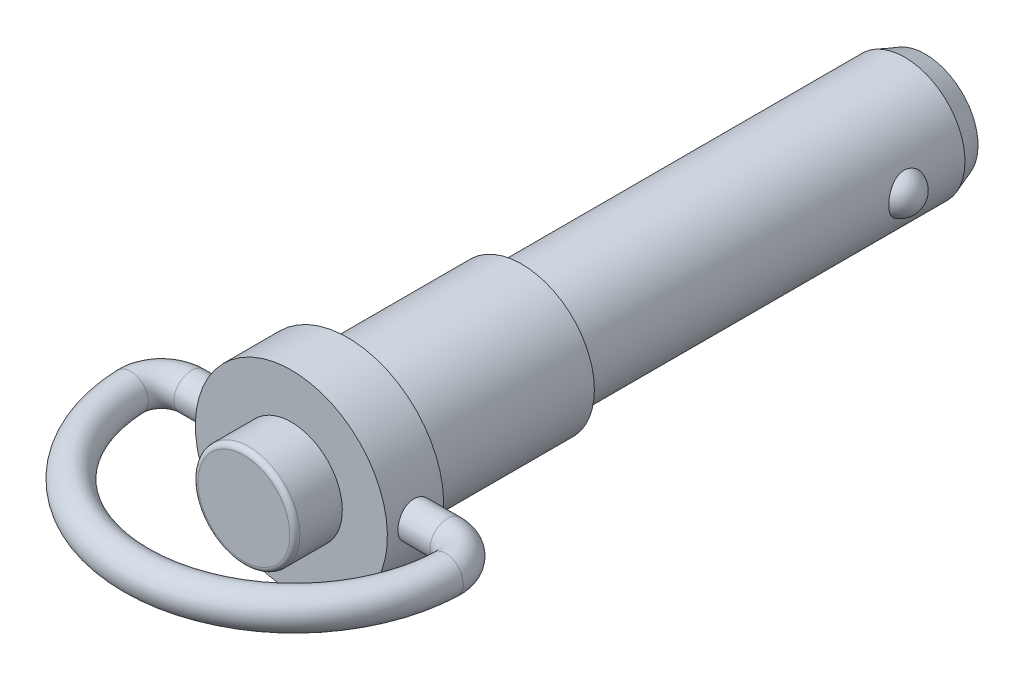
ISO-10303-21;
HEADER;
FILE_DESCRIPTION(('STEP AP214'),'2;1');
FILE_NAME('part.step','',(''),(''),'','','');
FILE_SCHEMA(('AUTOMOTIVE_DESIGN { 1 0 10303 214 1 1 1 1 }'));
ENDSEC;
DATA;
#1=APPLICATION_CONTEXT('core data for automotive mechanical design processes');
#2=APPLICATION_PROTOCOL_DEFINITION('international standard','automotive_design',2000,#1);
#3=PRODUCT_CONTEXT('',#1,'mechanical');
#4=PRODUCT('Part','Part','',(#3));
#5=PRODUCT_RELATED_PRODUCT_CATEGORY('part','',(#4));
#6=PRODUCT_DEFINITION_FORMATION('','',#4);
#7=PRODUCT_DEFINITION_CONTEXT('part definition',#1,'design');
#8=PRODUCT_DEFINITION('design','',#6,#7);
#9=PRODUCT_DEFINITION_SHAPE('','',#8);
#10=(LENGTH_UNIT() NAMED_UNIT(*) SI_UNIT(.MILLI.,.METRE.));
#11=(NAMED_UNIT(*) PLANE_ANGLE_UNIT() SI_UNIT($,.RADIAN.));
#12=(NAMED_UNIT(*) SI_UNIT($,.STERADIAN.) SOLID_ANGLE_UNIT());
#13=UNCERTAINTY_MEASURE_WITH_UNIT(LENGTH_MEASURE(1.E-05),#10,'distance_accuracy_value','');
#14=(GEOMETRIC_REPRESENTATION_CONTEXT(3) GLOBAL_UNCERTAINTY_ASSIGNED_CONTEXT((#13)) GLOBAL_UNIT_ASSIGNED_CONTEXT((#10,
#11,#12)) REPRESENTATION_CONTEXT('',''));
#15=CARTESIAN_POINT('',(0.,0.,0.));
#16=DIRECTION('',(0.,0.,1.));
#17=DIRECTION('',(1.,0.,0.));
#18=AXIS2_PLACEMENT_3D('',#15,#16,#17);
#19=CARTESIAN_POINT('',(0.,0.,0.));
#20=DIRECTION('',(0.,0.,-1.));
#21=DIRECTION('',(0.,-1.,0.));
#22=AXIS2_PLACEMENT_3D('',#19,#20,#21);
#23=CYLINDRICAL_SURFACE('',#22,9.525);
#24=CARTESIAN_POINT('',(0.,0.,17.272));
#25=DIRECTION('',(0.,0.,-1.));
#26=DIRECTION('',(0.,-1.,0.));
#27=AXIS2_PLACEMENT_3D('',#24,#25,#26);
#28=CIRCLE('',#27,9.525);
#29=CARTESIAN_POINT('',(0.,-9.525,17.272));
#30=VERTEX_POINT('',#29);
#31=EDGE_CURVE('E29',#30,#30,#28,.T.);
#32=ORIENTED_EDGE('',*,*,#31,.F.);
#33=EDGE_LOOP('',(#32));
#34=FACE_BOUND('',#33,.T.);
#35=CARTESIAN_POINT('',(0.,0.,22.86));
#36=DIRECTION('',(0.,0.,-1.));
#37=DIRECTION('',(0.,-1.,0.));
#38=AXIS2_PLACEMENT_3D('',#35,#36,#37);
#39=CIRCLE('',#38,9.525);
#40=CARTESIAN_POINT('',(0.,-9.525,22.86));
#41=VERTEX_POINT('',#40);
#42=EDGE_CURVE('E121',#41,#41,#39,.T.);
#43=ORIENTED_EDGE('',*,*,#42,.T.);
#44=EDGE_LOOP('',(#43));
#45=FACE_BOUND('',#44,.T.);
#46=CARTESIAN_POINT('',(-9.525,0.,18.316));
#47=CARTESIAN_POINT('',(-9.52499824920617,-0.097419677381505,18.3160037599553));
#48=CARTESIAN_POINT('',(-9.52348996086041,-0.194888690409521,18.3241622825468));
#49=CARTESIAN_POINT('',(-9.51761845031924,-0.387082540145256,18.3565612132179));
#50=CARTESIAN_POINT('',(-9.5132527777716,-0.481804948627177,18.3808154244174));
#51=CARTESIAN_POINT('',(-9.50215510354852,-0.665698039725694,18.4446400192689));
#52=CARTESIAN_POINT('',(-9.49542520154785,-0.754873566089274,18.4841968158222));
#53=CARTESIAN_POINT('',(-9.48033492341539,-0.925313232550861,18.5774656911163));
#54=CARTESIAN_POINT('',(-9.4719746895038,-1.00657806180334,18.6311765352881));
#55=CARTESIAN_POINT('',(-9.45443959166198,-1.15983447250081,18.75188590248));
#56=CARTESIAN_POINT('',(-9.44525721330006,-1.23172173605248,18.8190157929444));
#57=CARTESIAN_POINT('',(-9.42716883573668,-1.36328019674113,18.9643750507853));
#58=CARTESIAN_POINT('',(-9.41826285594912,-1.4229505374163,19.0426051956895));
#59=CARTESIAN_POINT('',(-9.40166266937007,-1.52881224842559,19.2086776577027));
#60=CARTESIAN_POINT('',(-9.39397815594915,-1.57489805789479,19.2965883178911));
#61=CARTESIAN_POINT('',(-9.3807965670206,-1.65160688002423,19.4790688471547));
#62=CARTESIAN_POINT('',(-9.3752993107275,-1.68223117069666,19.5736381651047));
#63=CARTESIAN_POINT('',(-9.36719014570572,-1.72681399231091,19.7656372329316));
#64=CARTESIAN_POINT('',(-9.36454682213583,-1.74095411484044,19.8630234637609));
#65=CARTESIAN_POINT('',(-9.36235004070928,-1.7527307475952,20.0588192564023));
#66=CARTESIAN_POINT('',(-9.3627963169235,-1.75036867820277,20.1572287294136));
#67=CARTESIAN_POINT('',(-9.36669969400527,-1.72935535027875,20.3509656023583));
#68=CARTESIAN_POINT('',(-9.37011871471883,-1.71091010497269,20.4463162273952));
#69=CARTESIAN_POINT('',(-9.37952256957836,-1.65857824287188,20.63254610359));
#70=CARTESIAN_POINT('',(-9.38550750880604,-1.62469099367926,20.7234251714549));
#71=CARTESIAN_POINT('',(-9.39940890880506,-1.54223419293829,20.8987376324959));
#72=CARTESIAN_POINT('',(-9.40733632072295,-1.49358101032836,20.9831307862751));
#73=CARTESIAN_POINT('',(-9.42422213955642,-1.38303261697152,21.14263300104));
#74=CARTESIAN_POINT('',(-9.43318064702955,-1.32113611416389,21.2177411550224));
#75=CARTESIAN_POINT('',(-9.45128545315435,-1.184745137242,21.35773204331));
#76=CARTESIAN_POINT('',(-9.46043254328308,-1.11007434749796,21.4224430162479));
#77=CARTESIAN_POINT('',(-9.47775926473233,-0.950845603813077,21.5384452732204));
#78=CARTESIAN_POINT('',(-9.48593888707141,-0.86628755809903,21.5897364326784));
#79=CARTESIAN_POINT('',(-9.50042458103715,-0.689508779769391,21.6774665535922));
#80=CARTESIAN_POINT('',(-9.50672846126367,-0.597279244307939,21.7138881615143));
#81=CARTESIAN_POINT('',(-9.51673535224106,-0.407869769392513,21.7706743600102));
#82=CARTESIAN_POINT('',(-9.52043862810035,-0.310690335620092,21.7910405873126));
#83=CARTESIAN_POINT('',(-9.5247907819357,-0.115617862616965,21.8149000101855));
#84=CARTESIAN_POINT('',(-9.52548227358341,-0.0177545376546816,21.818628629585));
#85=CARTESIAN_POINT('',(-9.52385046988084,0.177197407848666,21.8097377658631));
#86=CARTESIAN_POINT('',(-9.52152731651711,0.274286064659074,21.7971190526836));
#87=CARTESIAN_POINT('',(-9.51415375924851,0.464189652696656,21.7560874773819));
#88=CARTESIAN_POINT('',(-9.50912384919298,0.557031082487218,21.7277932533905));
#89=CARTESIAN_POINT('',(-9.49689842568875,0.736652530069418,21.6563418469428));
#90=CARTESIAN_POINT('',(-9.48970276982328,0.823432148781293,21.6131836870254));
#91=CARTESIAN_POINT('',(-9.47383776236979,0.989474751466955,21.5127050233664));
#92=CARTESIAN_POINT('',(-9.46515367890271,1.06864888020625,21.455240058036));
#93=CARTESIAN_POINT('',(-9.44731421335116,1.21631462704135,21.3279750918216));
#94=CARTESIAN_POINT('',(-9.43815878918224,1.28480528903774,21.258173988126));
#95=CARTESIAN_POINT('',(-9.42026781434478,1.41005035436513,21.1071541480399));
#96=CARTESIAN_POINT('',(-9.41153908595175,1.46664438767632,21.0258014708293));
#97=CARTESIAN_POINT('',(-9.39562517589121,1.56536359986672,20.854605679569));
#98=CARTESIAN_POINT('',(-9.38843993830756,1.60748930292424,20.7647628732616));
#99=CARTESIAN_POINT('',(-9.3764796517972,1.67584630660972,20.5795520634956));
#100=CARTESIAN_POINT('',(-9.37169329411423,1.70215230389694,20.4842123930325));
#101=CARTESIAN_POINT('',(-9.36504636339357,1.73835449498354,20.2903706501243));
#102=CARTESIAN_POINT('',(-9.36318547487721,1.74825245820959,20.1918689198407));
#103=CARTESIAN_POINT('',(-9.3626157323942,1.75130025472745,19.9961045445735));
#104=CARTESIAN_POINT('',(-9.36385929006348,1.74470294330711,19.8988458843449));
#105=CARTESIAN_POINT('',(-9.36925303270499,1.71549975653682,19.7068488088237));
#106=CARTESIAN_POINT('',(-9.3734032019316,1.69289396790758,19.6121103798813));
#107=CARTESIAN_POINT('',(-9.3841228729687,1.6324203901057,19.4279718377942));
#108=CARTESIAN_POINT('',(-9.39068820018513,1.5945789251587,19.3385628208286));
#109=CARTESIAN_POINT('',(-9.40550157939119,1.50473547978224,19.167322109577));
#110=CARTESIAN_POINT('',(-9.41374974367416,1.45273255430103,19.0854909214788));
#111=CARTESIAN_POINT('',(-9.43114776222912,1.33515884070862,18.9304600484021));
#112=CARTESIAN_POINT('',(-9.44030888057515,1.26940363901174,18.8574014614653));
#113=CARTESIAN_POINT('',(-9.45841527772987,1.12657740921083,18.7232704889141));
#114=CARTESIAN_POINT('',(-9.4673605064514,1.04950378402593,18.6622008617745));
#115=CARTESIAN_POINT('',(-9.4841172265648,0.885436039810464,18.5532929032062));
#116=CARTESIAN_POINT('',(-9.49191831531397,0.798362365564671,18.5055727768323));
#117=CARTESIAN_POINT('',(-9.50540634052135,0.617319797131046,18.4255142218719));
#118=CARTESIAN_POINT('',(-9.51109528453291,0.523357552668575,18.3931611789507));
#119=CARTESIAN_POINT('',(-9.51854259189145,0.357584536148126,18.3514108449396));
#120=CARTESIAN_POINT('',(-9.52095058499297,0.286749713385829,18.3381541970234));
#121=CARTESIAN_POINT('',(-9.52417991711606,0.143952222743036,18.3204474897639));
#122=CARTESIAN_POINT('',(-9.52500129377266,0.0719895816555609,18.3159972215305));
#123=CARTESIAN_POINT('',(-9.525,0.,18.316));
#124=B_SPLINE_CURVE_WITH_KNOTS('',3,(#46,#47,#48,#49,#50,#51,#52,#53,#54,#55,#56,#57,#58,#59,
#60,#61,#62,#63,#64,#65,#66,#67,#68,#69,#70,#71,#72,#73,#74,#75,#76,#77,#78,#79,#80,#81,#82,#83,
#84,#85,#86,#87,#88,#89,#90,#91,#92,#93,#94,#95,#96,#97,#98,#99,#100,#101,#102,#103,#104,#105,
#106,#107,#108,#109,#110,#111,#112,#113,#114,#115,#116,#117,#118,#119,#120,#121,#122,#123),
.UNSPECIFIED.,.T.,.F.,(4,2,2,2,2,2,2,2,2,2,2,2,2,2,2,2,2,2,2,2,2,2,2,2,2,2,2,2,2,2,2,2,2,2,2,2,
2,2,4),(0.,0.291995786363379,0.584242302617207,0.876229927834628,1.16819209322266,
1.46316632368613,1.75816122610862,2.05539140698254,2.35259701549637,2.64649667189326,
2.94037103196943,3.23053548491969,3.52071182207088,3.81256333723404,4.10444333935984,
4.40073615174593,4.69703171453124,4.9936720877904,5.29028221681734,5.58268169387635,
5.87506739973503,6.1652698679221,6.45549142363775,6.74877158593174,7.04207797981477,
7.3391152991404,7.63614185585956,7.93175468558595,8.22733563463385,8.51841349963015,
8.80948978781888,9.10006529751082,9.39066020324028,9.68543533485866,9.98027821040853,
10.2776546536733,10.574747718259,10.7905270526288,11.0063012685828),.UNSPECIFIED.);
#125=CARTESIAN_POINT('',(-9.525,0.,18.316));
#126=VERTEX_POINT('',#125);
#127=EDGE_CURVE('E8',#126,#126,#124,.T.);
#128=ORIENTED_EDGE('',*,*,#127,.F.);
#129=EDGE_LOOP('',(#128));
#130=FACE_BOUND('',#129,.T.);
#131=CARTESIAN_POINT('',(9.525,0.,21.816));
#132=CARTESIAN_POINT('',(9.52499824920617,0.0974196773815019,21.8159962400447));
#133=CARTESIAN_POINT('',(9.52348996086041,0.194888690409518,21.8078377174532));
#134=CARTESIAN_POINT('',(9.51761845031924,0.387082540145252,21.7754387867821));
#135=CARTESIAN_POINT('',(9.5132527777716,0.481804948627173,21.7511845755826));
#136=CARTESIAN_POINT('',(9.50215510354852,0.66569803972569,21.6873599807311));
#137=CARTESIAN_POINT('',(9.49542520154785,0.75487356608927,21.6478031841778));
#138=CARTESIAN_POINT('',(9.48033492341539,0.925313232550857,21.5545343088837));
#139=CARTESIAN_POINT('',(9.4719746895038,1.00657806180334,21.5008234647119));
#140=CARTESIAN_POINT('',(9.45443959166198,1.15983447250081,21.38011409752));
#141=CARTESIAN_POINT('',(9.44525721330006,1.23172173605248,21.3129842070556));
#142=CARTESIAN_POINT('',(9.42716883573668,1.36328019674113,21.1676249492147));
#143=CARTESIAN_POINT('',(9.41826285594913,1.42295053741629,21.0893948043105));
#144=CARTESIAN_POINT('',(9.40166266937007,1.52881224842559,20.9233223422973));
#145=CARTESIAN_POINT('',(9.39397815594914,1.57489805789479,20.8354116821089));
#146=CARTESIAN_POINT('',(9.3807965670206,1.65160688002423,20.6529311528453));
#147=CARTESIAN_POINT('',(9.3752993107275,1.68223117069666,20.5583618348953));
#148=CARTESIAN_POINT('',(9.36719014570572,1.72681399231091,20.3663627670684));
#149=CARTESIAN_POINT('',(9.36454682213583,1.74095411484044,20.2689765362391));
#150=CARTESIAN_POINT('',(9.36235004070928,1.75273074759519,20.0731807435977));
#151=CARTESIAN_POINT('',(9.3627963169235,1.75036867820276,19.9747712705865));
#152=CARTESIAN_POINT('',(9.36669969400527,1.72935535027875,19.7810343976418));
#153=CARTESIAN_POINT('',(9.37011871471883,1.71091010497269,19.6856837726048));
#154=CARTESIAN_POINT('',(9.37952256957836,1.65857824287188,19.49945389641));
#155=CARTESIAN_POINT('',(9.38550750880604,1.62469099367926,19.4085748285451));
#156=CARTESIAN_POINT('',(9.39940890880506,1.54223419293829,19.2332623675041));
#157=CARTESIAN_POINT('',(9.40733632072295,1.49358101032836,19.1488692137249));
#158=CARTESIAN_POINT('',(9.42422213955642,1.38303261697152,18.98936699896));
#159=CARTESIAN_POINT('',(9.43318064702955,1.32113611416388,18.9142588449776));
#160=CARTESIAN_POINT('',(9.45128545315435,1.184745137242,18.77426795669));
#161=CARTESIAN_POINT('',(9.46043254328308,1.11007434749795,18.7095569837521));
#162=CARTESIAN_POINT('',(9.47775926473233,0.950845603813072,18.5935547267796));
#163=CARTESIAN_POINT('',(9.48593888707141,0.866287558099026,18.5422635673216));
#164=CARTESIAN_POINT('',(9.50042458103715,0.689508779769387,18.4545334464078));
#165=CARTESIAN_POINT('',(9.50672846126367,0.597279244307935,18.4181118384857));
#166=CARTESIAN_POINT('',(9.51673535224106,0.407869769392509,18.3613256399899));
#167=CARTESIAN_POINT('',(9.52043862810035,0.310690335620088,18.3409594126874));
#168=CARTESIAN_POINT('',(9.5247907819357,0.115617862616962,18.3170999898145));
#169=CARTESIAN_POINT('',(9.52548227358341,0.0177545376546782,18.313371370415));
#170=CARTESIAN_POINT('',(9.52385046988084,-0.17719740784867,18.3222622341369));
#171=CARTESIAN_POINT('',(9.52152731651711,-0.274286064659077,18.3348809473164));
#172=CARTESIAN_POINT('',(9.51415375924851,-0.46418965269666,18.3759125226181));
#173=CARTESIAN_POINT('',(9.50912384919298,-0.557031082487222,18.4042067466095));
#174=CARTESIAN_POINT('',(9.49689842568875,-0.736652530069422,18.4756581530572));
#175=CARTESIAN_POINT('',(9.48970276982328,-0.823432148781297,18.5188163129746));
#176=CARTESIAN_POINT('',(9.47383776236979,-0.98947475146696,18.6192949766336));
#177=CARTESIAN_POINT('',(9.46515367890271,-1.06864888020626,18.676759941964));
#178=CARTESIAN_POINT('',(9.44731421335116,-1.21631462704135,18.8040249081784));
#179=CARTESIAN_POINT('',(9.43815878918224,-1.28480528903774,18.873826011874));
#180=CARTESIAN_POINT('',(9.42026781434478,-1.41005035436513,19.0248458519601));
#181=CARTESIAN_POINT('',(9.41153908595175,-1.46664438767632,19.1061985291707));
#182=CARTESIAN_POINT('',(9.39562517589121,-1.56536359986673,19.277394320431));
#183=CARTESIAN_POINT('',(9.38843993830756,-1.60748930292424,19.3672371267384));
#184=CARTESIAN_POINT('',(9.3764796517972,-1.67584630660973,19.5524479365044));
#185=CARTESIAN_POINT('',(9.37169329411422,-1.70215230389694,19.6477876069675));
#186=CARTESIAN_POINT('',(9.36504636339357,-1.73835449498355,19.8416293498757));
#187=CARTESIAN_POINT('',(9.36318547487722,-1.7482524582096,19.9401310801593));
#188=CARTESIAN_POINT('',(9.3626157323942,-1.75130025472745,20.1358954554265));
#189=CARTESIAN_POINT('',(9.36385929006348,-1.74470294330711,20.2331541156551));
#190=CARTESIAN_POINT('',(9.36925303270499,-1.71549975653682,20.4251511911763));
#191=CARTESIAN_POINT('',(9.37340320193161,-1.69289396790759,20.5198896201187));
#192=CARTESIAN_POINT('',(9.38412287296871,-1.63242039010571,20.7040281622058));
#193=CARTESIAN_POINT('',(9.39068820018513,-1.5945789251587,20.7934371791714));
#194=CARTESIAN_POINT('',(9.40550157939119,-1.50473547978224,20.964677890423));
#195=CARTESIAN_POINT('',(9.41374974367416,-1.45273255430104,21.0465090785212));
#196=CARTESIAN_POINT('',(9.43114776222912,-1.33515884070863,21.2015399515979));
#197=CARTESIAN_POINT('',(9.44030888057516,-1.26940363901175,21.2745985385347));
#198=CARTESIAN_POINT('',(9.45841527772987,-1.12657740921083,21.4087295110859));
#199=CARTESIAN_POINT('',(9.4673605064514,-1.04950378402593,21.4697991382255));
#200=CARTESIAN_POINT('',(9.4841172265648,-0.885436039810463,21.5787070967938));
#201=CARTESIAN_POINT('',(9.49191831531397,-0.798362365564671,21.6264272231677));
#202=CARTESIAN_POINT('',(9.50540634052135,-0.617319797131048,21.7064857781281));
#203=CARTESIAN_POINT('',(9.51109528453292,-0.523357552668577,21.7388388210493));
#204=CARTESIAN_POINT('',(9.51854259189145,-0.357584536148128,21.7805891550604));
#205=CARTESIAN_POINT('',(9.52095058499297,-0.286749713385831,21.7938458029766));
#206=CARTESIAN_POINT('',(9.52417991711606,-0.143952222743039,21.8115525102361));
#207=CARTESIAN_POINT('',(9.52500129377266,-0.0719895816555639,21.8160027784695));
#208=CARTESIAN_POINT('',(9.525,0.,21.816));
#209=B_SPLINE_CURVE_WITH_KNOTS('',3,(#131,#132,#133,#134,#135,#136,#137,#138,#139,#140,#141,
#142,#143,#144,#145,#146,#147,#148,#149,#150,#151,#152,#153,#154,#155,#156,#157,#158,#159,#160,
#161,#162,#163,#164,#165,#166,#167,#168,#169,#170,#171,#172,#173,#174,#175,#176,#177,#178,#179,
#180,#181,#182,#183,#184,#185,#186,#187,#188,#189,#190,#191,#192,#193,#194,#195,#196,#197,#198,
#199,#200,#201,#202,#203,#204,#205,#206,#207,#208),.UNSPECIFIED.,.T.,.F.,(4,2,2,2,2,2,2,2,2,2,2,
2,2,2,2,2,2,2,2,2,2,2,2,2,2,2,2,2,2,2,2,2,2,2,2,2,2,2,4),(0.,0.291995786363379,
0.584242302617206,0.876229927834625,1.16819209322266,1.46316632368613,1.75816122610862,
2.05539140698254,2.35259701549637,2.64649667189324,2.94037103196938,3.23053548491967,
3.52071182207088,3.81256333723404,4.10444333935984,4.40073615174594,4.69703171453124,
4.9936720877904,5.29028221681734,5.58268169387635,5.87506739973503,6.1652698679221,
6.45549142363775,6.74877158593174,7.04207797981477,7.3391152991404,7.63614185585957,
7.93175468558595,8.22733563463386,8.51841349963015,8.80948978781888,9.10006529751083,
9.39066020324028,9.68543533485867,9.98027821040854,10.2776546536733,10.574747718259,
10.7905270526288,11.0063012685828),.UNSPECIFIED.);
#210=CARTESIAN_POINT('',(9.525,0.,21.816));
#211=VERTEX_POINT('',#210);
#212=EDGE_CURVE('E16',#211,#211,#209,.T.);
#213=ORIENTED_EDGE('',*,*,#212,.T.);
#214=EDGE_LOOP('',(#213));
#215=FACE_BOUND('',#214,.T.);
#216=ADVANCED_FACE('F12',(#34,#45,#130,#215),#23,.T.);
#217=CARTESIAN_POINT('',(0.,0.,28.575));
#218=DIRECTION('',(0.,0.,-1.));
#219=DIRECTION('',(0.,-1.,0.));
#220=AXIS2_PLACEMENT_3D('',#217,#218,#219);
#221=CYLINDRICAL_SURFACE('',#220,5.0546);
#222=CARTESIAN_POINT('',(0.,0.,27.075));
#223=DIRECTION('',(0.,0.,1.));
#224=DIRECTION('',(1.,0.,0.));
#225=AXIS2_PLACEMENT_3D('',#222,#223,#224);
#226=CIRCLE('',#225,5.0546);
#227=CARTESIAN_POINT('',(5.0546,0.,27.075));
#228=VERTEX_POINT('',#227);
#229=EDGE_CURVE('E142',#228,#228,#226,.T.);
#230=ORIENTED_EDGE('',*,*,#229,.F.);
#231=EDGE_LOOP('',(#230));
#232=FACE_BOUND('',#231,.T.);
#233=CARTESIAN_POINT('',(0.,0.,22.86));
#234=DIRECTION('',(0.,0.,-1.));
#235=DIRECTION('',(0.,-1.,0.));
#236=AXIS2_PLACEMENT_3D('',#233,#234,#235);
#237=CIRCLE('',#236,5.0546);
#238=CARTESIAN_POINT('',(0.,-5.0546,22.86));
#239=VERTEX_POINT('',#238);
#240=EDGE_CURVE('E36',#239,#239,#237,.T.);
#241=ORIENTED_EDGE('',*,*,#240,.F.);
#242=EDGE_LOOP('',(#241));
#243=FACE_BOUND('',#242,.T.);
#244=ADVANCED_FACE('F131',(#232,#243),#221,.T.);
#245=CARTESIAN_POINT('',(-9.525,0.,22.86));
#246=DIRECTION('',(0.,0.,1.));
#247=DIRECTION('',(0.,1.,0.));
#248=AXIS2_PLACEMENT_3D('',#245,#246,#247);
#249=PLANE('',#248);
#250=ORIENTED_EDGE('',*,*,#240,.T.);
#251=EDGE_LOOP('',(#250));
#252=FACE_BOUND('',#251,.T.);
#253=ORIENTED_EDGE('',*,*,#42,.F.);
#254=EDGE_LOOP('',(#253));
#255=FACE_BOUND('',#254,.T.);
#256=ADVANCED_FACE('F128',(#252,#255),#249,.T.);
#257=CARTESIAN_POINT('',(-8.9535,0.,17.272));
#258=DIRECTION('',(0.,0.,-1.));
#259=DIRECTION('',(0.,-1.,0.));
#260=AXIS2_PLACEMENT_3D('',#257,#258,#259);
#261=PLANE('',#260);
#262=ORIENTED_EDGE('',*,*,#31,.T.);
#263=EDGE_LOOP('',(#262));
#264=FACE_BOUND('',#263,.T.);
#265=CARTESIAN_POINT('',(0.,0.,17.272));
#266=DIRECTION('',(0.,0.,1.));
#267=DIRECTION('',(1.,0.,0.));
#268=AXIS2_PLACEMENT_3D('',#265,#266,#267);
#269=CIRCLE('',#268,7.6);
#270=CARTESIAN_POINT('',(7.6,0.,17.272));
#271=VERTEX_POINT('',#270);
#272=EDGE_CURVE('E143',#271,#271,#269,.T.);
#273=ORIENTED_EDGE('',*,*,#272,.T.);
#274=EDGE_LOOP('',(#273));
#275=FACE_BOUND('',#274,.T.);
#276=ADVANCED_FACE('F76',(#264,#275),#261,.T.);
#277=CARTESIAN_POINT('',(0.,0.,30.025216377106));
#278=DIRECTION('',(0.,0.,1.));
#279=DIRECTION('',(1.,0.,0.));
#280=AXIS2_PLACEMENT_3D('',#277,#278,#279);
#281=CYLINDRICAL_SURFACE('',#280,7.2);
#282=CARTESIAN_POINT('',(0.,0.,0.));
#283=DIRECTION('',(0.,0.,1.));
#284=DIRECTION('',(1.,0.,0.));
#285=AXIS2_PLACEMENT_3D('',#282,#283,#284);
#286=CIRCLE('',#285,7.2);
#287=CARTESIAN_POINT('',(7.2,0.,0.));
#288=VERTEX_POINT('',#287);
#289=EDGE_CURVE('E119',#288,#288,#286,.T.);
#290=ORIENTED_EDGE('',*,*,#289,.T.);
#291=EDGE_LOOP('',(#290));
#292=FACE_BOUND('',#291,.T.);
#293=CARTESIAN_POINT('',(0.,0.,16.872));
#294=DIRECTION('',(0.,0.,1.));
#295=DIRECTION('',(1.,0.,0.));
#296=AXIS2_PLACEMENT_3D('',#293,#294,#295);
#297=CIRCLE('',#296,7.2);
#298=CARTESIAN_POINT('',(7.2,0.,16.872));
#299=VERTEX_POINT('',#298);
#300=EDGE_CURVE('E147',#299,#299,#297,.T.);
#301=ORIENTED_EDGE('',*,*,#300,.F.);
#302=EDGE_LOOP('',(#301));
#303=FACE_BOUND('',#302,.T.);
#304=ADVANCED_FACE('F72',(#292,#303),#281,.T.);
#305=CARTESIAN_POINT('',(0.,0.,16.872));
#306=DIRECTION('',(0.,0.,1.));
#307=DIRECTION('',(1.,0.,0.));
#308=AXIS2_PLACEMENT_3D('',#305,#306,#307);
#309=TOROIDAL_SURFACE('',#308,7.6,0.4);
#310=ORIENTED_EDGE('',*,*,#300,.T.);
#311=EDGE_LOOP('',(#310));
#312=FACE_BOUND('',#311,.T.);
#313=ORIENTED_EDGE('',*,*,#272,.F.);
#314=EDGE_LOOP('',(#313));
#315=FACE_BOUND('',#314,.T.);
#316=ADVANCED_FACE('F68',(#312,#315),#309,.F.);
#317=CARTESIAN_POINT('',(-5.23004748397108,0.,-40.0304));
#318=DIRECTION('',(0.,0.,1.));
#319=DIRECTION('',(0.,1.,0.));
#320=AXIS2_PLACEMENT_3D('',#317,#318,#319);
#321=PLANE('',#320);
#322=CARTESIAN_POINT('',(0.,0.,-40.0303999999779));
#323=DIRECTION('',(0.,0.,1.));
#324=DIRECTION('',(0.,1.,0.));
#325=AXIS2_PLACEMENT_3D('',#322,#323,#324);
#326=CIRCLE('',#325,5.23004748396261);
#327=CARTESIAN_POINT('',(0.,5.23004748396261,-40.0303999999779));
#328=VERTEX_POINT('',#327);
#329=EDGE_CURVE('E116',#328,#328,#326,.T.);
#330=ORIENTED_EDGE('',*,*,#329,.F.);
#331=EDGE_LOOP('',(#330));
#332=FACE_BOUND('',#331,.T.);
#333=ADVANCED_FACE('F71',(#332),#321,.F.);
#334=CARTESIAN_POINT('',(-5.24129,0.,-32.2834));
#335=DIRECTION('',(0.,0.,1.));
#336=DIRECTION('',(-1.,0.,0.));
#337=AXIS2_PLACEMENT_3D('',#334,#335,#336);
#338=SPHERICAL_SURFACE('',#337,1.98374);
#339=CARTESIAN_POINT('',(-5.969635,0.,-30.4382067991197));
#340=CARTESIAN_POINT('',(-5.96963006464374,-0.111015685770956,-30.4382116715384));
#341=CARTESIAN_POINT('',(-5.96650644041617,-0.222143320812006,-30.4470278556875));
#342=CARTESIAN_POINT('',(-5.95431160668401,-0.441381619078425,-30.4821762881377));
#343=CARTESIAN_POINT('',(-5.9452309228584,-0.549487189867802,-30.5085364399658));
#344=CARTESIAN_POINT('',(-5.92206953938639,-0.759461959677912,-30.5783068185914));
#345=CARTESIAN_POINT('',(-5.90799052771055,-0.861333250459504,-30.6217112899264));
#346=CARTESIAN_POINT('',(-5.87633956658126,-1.05588670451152,-30.7247452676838));
#347=CARTESIAN_POINT('',(-5.85876868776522,-1.14857167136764,-30.7843698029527));
#348=CARTESIAN_POINT('',(-5.82223010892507,-1.32133430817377,-30.9181231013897));
#349=CARTESIAN_POINT('',(-5.80327429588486,-1.40150415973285,-30.9921358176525));
#350=CARTESIAN_POINT('',(-5.76604946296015,-1.54754922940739,-31.1533071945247));
#351=CARTESIAN_POINT('',(-5.74778035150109,-1.61342635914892,-31.2404640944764));
#352=CARTESIAN_POINT('',(-5.71483308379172,-1.72643370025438,-31.4221868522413));
#353=CARTESIAN_POINT('',(-5.70004608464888,-1.77417349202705,-31.5163531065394));
#354=CARTESIAN_POINT('',(-5.67505831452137,-1.85255616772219,-31.7121159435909));
#355=CARTESIAN_POINT('',(-5.66485545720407,-1.88320683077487,-31.8137091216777));
#356=CARTESIAN_POINT('',(-5.65080765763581,-1.92493419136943,-32.0148687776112));
#357=CARTESIAN_POINT('',(-5.64661793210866,-1.9370751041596,-32.1141910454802));
#358=CARTESIAN_POINT('',(-5.64397531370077,-1.94476367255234,-32.3135411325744));
#359=CARTESIAN_POINT('',(-5.64552102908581,-1.94031535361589,-32.4135687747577));
#360=CARTESIAN_POINT('',(-5.65399944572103,-1.9154603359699,-32.6076677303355));
#361=CARTESIAN_POINT('',(-5.66073469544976,-1.89563839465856,-32.7018234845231));
#362=CARTESIAN_POINT('',(-5.67860059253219,-1.84142507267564,-32.8853806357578));
#363=CARTESIAN_POINT('',(-5.68973152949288,-1.80703273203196,-32.9747817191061));
#364=CARTESIAN_POINT('',(-5.71546454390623,-1.72392617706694,-33.1482988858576));
#365=CARTESIAN_POINT('',(-5.730129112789,-1.67494987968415,-33.2322806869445));
#366=CARTESIAN_POINT('',(-5.75347973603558,-1.59211635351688,-33.3513225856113));
#367=CARTESIAN_POINT('',(-5.7614912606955,-1.56293448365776,-33.38985758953));
#368=CARTESIAN_POINT('',(-5.7777780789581,-1.50160973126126,-33.464489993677));
#369=CARTESIAN_POINT('',(-5.78605358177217,-1.46946445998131,-33.5005853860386));
#370=CARTESIAN_POINT('',(-5.81187985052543,-1.36524181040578,-33.6087062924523));
#371=CARTESIAN_POINT('',(-5.82954302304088,-1.2884006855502,-33.6762048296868));
#372=CARTESIAN_POINT('',(-5.86333936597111,-1.12462015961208,-33.7980676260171));
#373=CARTESIAN_POINT('',(-5.87947206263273,-1.0376776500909,-33.8524278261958));
#374=CARTESIAN_POINT('',(-5.90173079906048,-0.899149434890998,-33.9246002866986));
#375=CARTESIAN_POINT('',(-5.9089754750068,-0.850337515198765,-33.9475231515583));
#376=CARTESIAN_POINT('',(-5.92242841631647,-0.750927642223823,-33.989369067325));
#377=CARTESIAN_POINT('',(-5.92863755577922,-0.700331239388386,-34.0082954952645));
#378=CARTESIAN_POINT('',(-5.939859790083,-0.597720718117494,-34.0420647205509));
#379=CARTESIAN_POINT('',(-5.9448739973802,-0.545707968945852,-34.0569113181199));
#380=CARTESIAN_POINT('',(-5.95358843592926,-0.44057792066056,-34.08248082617));
#381=CARTESIAN_POINT('',(-5.95728882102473,-0.387460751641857,-34.093204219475));
#382=CARTESIAN_POINT('',(-5.96337469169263,-0.278836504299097,-34.1107463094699));
#383=CARTESIAN_POINT('',(-5.96571659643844,-0.223305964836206,-34.1174358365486));
#384=CARTESIAN_POINT('',(-5.96884799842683,-0.111859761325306,-34.1263605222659));
#385=CARTESIAN_POINT('',(-5.96963748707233,-0.0559440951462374,-34.1285956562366));
#386=CARTESIAN_POINT('',(-5.96963006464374,0.111015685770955,-34.1285883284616));
#387=CARTESIAN_POINT('',(-5.96650644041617,0.222143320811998,-34.1197721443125));
#388=CARTESIAN_POINT('',(-5.95431160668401,0.441381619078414,-34.0846237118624));
#389=CARTESIAN_POINT('',(-5.94523092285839,0.549487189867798,-34.0582635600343));
#390=CARTESIAN_POINT('',(-5.9220695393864,0.759461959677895,-33.9884931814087));
#391=CARTESIAN_POINT('',(-5.90799052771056,0.861333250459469,-33.9450887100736));
#392=CARTESIAN_POINT('',(-5.87633956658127,1.05588670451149,-33.8420547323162));
#393=CARTESIAN_POINT('',(-5.85876868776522,1.14857167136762,-33.7824301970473));
#394=CARTESIAN_POINT('',(-5.82223010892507,1.32133430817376,-33.6486768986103));
#395=CARTESIAN_POINT('',(-5.80327429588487,1.40150415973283,-33.5746641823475));
#396=CARTESIAN_POINT('',(-5.76604946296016,1.54754922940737,-33.4134928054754));
#397=CARTESIAN_POINT('',(-5.74778035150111,1.6134263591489,-33.3263359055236));
#398=CARTESIAN_POINT('',(-5.71483308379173,1.72643370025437,-33.1446131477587));
#399=CARTESIAN_POINT('',(-5.70004608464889,1.77417349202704,-33.0504468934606));
#400=CARTESIAN_POINT('',(-5.67505831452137,1.85255616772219,-32.8546840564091));
#401=CARTESIAN_POINT('',(-5.66485545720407,1.88320683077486,-32.7530908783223));
#402=CARTESIAN_POINT('',(-5.65080765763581,1.92493419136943,-32.5519312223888));
#403=CARTESIAN_POINT('',(-5.64661793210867,1.9370751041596,-32.4526089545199));
#404=CARTESIAN_POINT('',(-5.64397531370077,1.94476367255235,-32.2532588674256));
#405=CARTESIAN_POINT('',(-5.64552102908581,1.9403153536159,-32.1532312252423));
#406=CARTESIAN_POINT('',(-5.65399944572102,1.91546033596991,-31.9591322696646));
#407=CARTESIAN_POINT('',(-5.66073469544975,1.89563839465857,-31.864976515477));
#408=CARTESIAN_POINT('',(-5.67860059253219,1.84142507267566,-31.6814193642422));
#409=CARTESIAN_POINT('',(-5.68973152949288,1.80703273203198,-31.5920182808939));
#410=CARTESIAN_POINT('',(-5.71546454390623,1.72392617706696,-31.4185011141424));
#411=CARTESIAN_POINT('',(-5.730129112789,1.67494987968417,-31.3345193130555));
#412=CARTESIAN_POINT('',(-5.75347973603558,1.59211635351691,-31.2154774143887));
#413=CARTESIAN_POINT('',(-5.76149126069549,1.5629344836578,-31.17694241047));
#414=CARTESIAN_POINT('',(-5.77777807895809,1.5016097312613,-31.102310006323));
#415=CARTESIAN_POINT('',(-5.78605358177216,1.46946445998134,-31.0662146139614));
#416=CARTESIAN_POINT('',(-5.81187985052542,1.3652418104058,-30.9580937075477));
#417=CARTESIAN_POINT('',(-5.82954302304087,1.28840068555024,-30.8905951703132));
#418=CARTESIAN_POINT('',(-5.8633393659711,1.12462015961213,-30.7687323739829));
#419=CARTESIAN_POINT('',(-5.87947206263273,1.03767765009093,-30.7143721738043));
#420=CARTESIAN_POINT('',(-5.90173079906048,0.899149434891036,-30.6421997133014));
#421=CARTESIAN_POINT('',(-5.90897547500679,0.850337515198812,-30.6192768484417));
#422=CARTESIAN_POINT('',(-5.92242841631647,0.750927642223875,-30.577430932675));
#423=CARTESIAN_POINT('',(-5.92863755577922,0.700331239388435,-30.5585045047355));
#424=CARTESIAN_POINT('',(-5.939859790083,0.597720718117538,-30.5247352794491));
#425=CARTESIAN_POINT('',(-5.9448739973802,0.545707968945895,-30.5098886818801));
#426=CARTESIAN_POINT('',(-5.95358843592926,0.440577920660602,-30.48431917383));
#427=CARTESIAN_POINT('',(-5.95728882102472,0.387460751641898,-30.473595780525));
#428=CARTESIAN_POINT('',(-5.96337469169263,0.278836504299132,-30.4560536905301));
#429=CARTESIAN_POINT('',(-5.96571659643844,0.223305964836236,-30.4493641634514));
#430=CARTESIAN_POINT('',(-5.96884799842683,0.111859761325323,-30.4404394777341));
#431=CARTESIAN_POINT('',(-5.96963748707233,0.0559440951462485,-30.4382043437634));
#432=CARTESIAN_POINT('',(-5.969635,0.,-30.4382067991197));
#433=B_SPLINE_CURVE_WITH_KNOTS('',3,(#339,#340,#341,#342,#343,#344,#345,#346,#347,#348,#349,
#350,#351,#352,#353,#354,#355,#356,#357,#358,#359,#360,#361,#362,#363,#364,#365,#366,#367,#368,
#369,#370,#371,#372,#373,#374,#375,#376,#377,#378,#379,#380,#381,#382,#383,#384,#385,#386,#387,
#388,#389,#390,#391,#392,#393,#394,#395,#396,#397,#398,#399,#400,#401,#402,#403,#404,#405,#406,
#407,#408,#409,#410,#411,#412,#413,#414,#415,#416,#417,#418,#419,#420,#421,#422,#423,#424,#425,
#426,#427,#428,#429,#430,#431,#432),.UNSPECIFIED.,.T.,.F.,(4,2,2,2,2,2,2,2,2,2,2,2,2,2,2,2,2,2,
2,2,2,2,2,2,2,2,2,2,2,2,2,2,2,2,2,2,2,2,2,2,2,2,2,2,2,2,4),(0.,0.332850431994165,
0.666231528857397,0.999500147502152,1.33266674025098,1.66325004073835,1.99378909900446,
2.31195183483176,2.62996962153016,2.92890394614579,3.22776573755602,3.51578606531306,
3.80382537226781,4.09739019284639,4.2442522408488,4.39123372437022,4.70115251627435,
5.0111669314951,5.17424099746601,5.33717670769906,5.49996013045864,5.66272448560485,
5.83045675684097,5.99818995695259,6.33104038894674,6.66442148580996,6.99769010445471,
7.33085669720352,7.66143999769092,7.99197905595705,8.31014179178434,8.62815957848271,
8.92709390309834,9.22595569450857,9.51397602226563,9.80201532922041,10.095580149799,
10.2424421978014,10.3894236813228,10.6993424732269,11.0093568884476,11.1724309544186,
11.3353666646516,11.4981500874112,11.6609144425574,11.8286467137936,11.9963799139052),.UNSPECIFIED.);
#434=CARTESIAN_POINT('',(-5.969635,0.,-30.4382067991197));
#435=VERTEX_POINT('',#434);
#436=EDGE_CURVE('E110',#435,#435,#433,.T.);
#437=ORIENTED_EDGE('',*,*,#436,.F.);
#438=EDGE_LOOP('',(#437));
#439=FACE_BOUND('',#438,.T.);
#440=ADVANCED_FACE('F80',(#439),#338,.T.);
#441=CARTESIAN_POINT('',(5.24123,0.,-32.2834));
#442=DIRECTION('',(0.,0.,1.));
#443=DIRECTION('',(-1.,0.,0.));
#444=AXIS2_PLACEMENT_3D('',#441,#442,#443);
#445=SPHERICAL_SURFACE('',#444,1.98374);
#446=CARTESIAN_POINT('',(5.969635,0.,-34.1285695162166));
#447=CARTESIAN_POINT('',(5.96963006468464,-0.11101538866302,-34.1285646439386));
#448=CARTESIAN_POINT('',(5.96650645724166,-0.222142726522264,-34.1197484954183));
#449=CARTESIAN_POINT('',(5.95431168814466,-0.441380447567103,-34.0846001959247));
#450=CARTESIAN_POINT('',(5.94523105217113,-0.549485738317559,-34.0582401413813));
#451=CARTESIAN_POINT('',(5.92206978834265,-0.759459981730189,-33.9884699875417));
#452=CARTESIAN_POINT('',(5.90799084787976,-0.861331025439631,-33.945065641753));
#453=CARTESIAN_POINT('',(5.87634005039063,-1.05588398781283,-33.8420319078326));
#454=CARTESIAN_POINT('',(5.85876926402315,-1.14856871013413,-33.782407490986));
#455=CARTESIAN_POINT('',(5.82223094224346,-1.32133060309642,-33.6486545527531));
#456=CARTESIAN_POINT('',(5.80327529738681,-1.40149998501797,-33.5746421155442));
#457=CARTESIAN_POINT('',(5.76605083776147,-1.54754408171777,-33.4134712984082));
#458=CARTESIAN_POINT('',(5.74778193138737,-1.61342070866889,-33.3263146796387));
#459=CARTESIAN_POINT('',(5.71483520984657,-1.72642663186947,-33.1445930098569));
#460=CARTESIAN_POINT('',(5.70004853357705,-1.7741656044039,-33.0504276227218));
#461=CARTESIAN_POINT('',(5.67506139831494,-1.8525467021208,-32.8546666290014));
#462=CARTESIAN_POINT('',(5.66485885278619,-1.88319660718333,-32.7530744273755));
#463=CARTESIAN_POINT('',(5.65081166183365,-1.92492242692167,-32.5519173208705));
#464=CARTESIAN_POINT('',(5.64662220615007,-1.9370626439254,-32.4525966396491));
#465=CARTESIAN_POINT('',(5.64398000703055,-1.94475005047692,-32.2532498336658));
#466=CARTESIAN_POINT('',(5.64552587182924,-1.94030126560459,-32.1532238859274));
#467=CARTESIAN_POINT('',(5.65400443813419,-1.91544560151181,-31.9591284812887));
#468=CARTESIAN_POINT('',(5.66073968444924,-1.89562349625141,-31.8649745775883));
#469=CARTESIAN_POINT('',(5.67860543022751,-1.84141015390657,-31.6814211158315));
#470=CARTESIAN_POINT('',(5.68973621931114,-1.80701795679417,-31.592021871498));
#471=CARTESIAN_POINT('',(5.71546883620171,-1.72391193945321,-31.418508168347));
#472=CARTESIAN_POINT('',(5.73013315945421,-1.67493601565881,-31.3345280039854));
#473=CARTESIAN_POINT('',(5.75348335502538,-1.5921032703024,-31.2154884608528));
#474=CARTESIAN_POINT('',(5.76149472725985,-1.56292169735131,-31.1769542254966));
#475=CARTESIAN_POINT('',(5.77778122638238,-1.50159761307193,-31.102323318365));
#476=CARTESIAN_POINT('',(5.78605656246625,-1.46945271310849,-31.0662286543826));
#477=CARTESIAN_POINT('',(5.81188236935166,-1.3652310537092,-30.9581096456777));
#478=CARTESIAN_POINT('',(5.82954523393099,-1.28839062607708,-30.8906122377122));
#479=CARTESIAN_POINT('',(5.86334097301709,-1.12461171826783,-30.7687514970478));
#480=CARTESIAN_POINT('',(5.87947337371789,-1.03767012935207,-30.7143922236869));
#481=CARTESIAN_POINT('',(5.90173174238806,-0.899143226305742,-30.6422208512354));
#482=CARTESIAN_POINT('',(5.90897632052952,-0.85033161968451,-30.6192982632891));
#483=CARTESIAN_POINT('',(5.92242907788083,-0.750922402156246,-30.5774528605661));
#484=CARTESIAN_POINT('',(5.92863813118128,-0.700326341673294,-30.5585266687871));
#485=CARTESIAN_POINT('',(5.93986020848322,-0.597716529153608,-30.5247578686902));
#486=CARTESIAN_POINT('',(5.94487434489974,-0.545704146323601,-30.5099114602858));
#487=CARTESIAN_POINT('',(5.95358865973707,-0.440574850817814,-30.4843422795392));
#488=CARTESIAN_POINT('',(5.95728899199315,-0.38745806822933,-30.4736190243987));
#489=CARTESIAN_POINT('',(5.96337477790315,-0.278834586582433,-30.4560771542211));
#490=CARTESIAN_POINT('',(5.96571665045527,-0.223304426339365,-30.4493877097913));
#491=CARTESIAN_POINT('',(5.96884800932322,-0.111858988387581,-30.4404631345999));
#492=CARTESIAN_POINT('',(5.96963748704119,-0.0559437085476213,-30.4382280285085));
#493=CARTESIAN_POINT('',(5.96963006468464,0.111015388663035,-30.4382353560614));
#494=CARTESIAN_POINT('',(5.96650645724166,0.222142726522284,-30.4470515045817));
#495=CARTESIAN_POINT('',(5.95431168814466,0.441380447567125,-30.4821998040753));
#496=CARTESIAN_POINT('',(5.94523105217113,0.549485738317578,-30.5085598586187));
#497=CARTESIAN_POINT('',(5.92206978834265,0.759459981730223,-30.5783300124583));
#498=CARTESIAN_POINT('',(5.90799084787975,0.861331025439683,-30.621734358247));
#499=CARTESIAN_POINT('',(5.87634005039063,1.05588398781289,-30.7247680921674));
#500=CARTESIAN_POINT('',(5.85876926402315,1.14856871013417,-30.7843925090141));
#501=CARTESIAN_POINT('',(5.82223094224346,1.32133060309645,-30.9181454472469));
#502=CARTESIAN_POINT('',(5.80327529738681,1.401499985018,-30.9921578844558));
#503=CARTESIAN_POINT('',(5.76605083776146,1.5475440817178,-31.1533287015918));
#504=CARTESIAN_POINT('',(5.74778193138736,1.61342070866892,-31.2404853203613));
#505=CARTESIAN_POINT('',(5.71483520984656,1.7264266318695,-31.4222069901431));
#506=CARTESIAN_POINT('',(5.70004853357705,1.77416560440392,-31.5163723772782));
#507=CARTESIAN_POINT('',(5.67506139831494,1.85254670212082,-31.7121333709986));
#508=CARTESIAN_POINT('',(5.66485885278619,1.88319660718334,-31.8137255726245));
#509=CARTESIAN_POINT('',(5.65081166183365,1.92492242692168,-32.0148826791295));
#510=CARTESIAN_POINT('',(5.64662220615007,1.93706264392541,-32.1142033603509));
#511=CARTESIAN_POINT('',(5.64398000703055,1.94475005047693,-32.3135501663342));
#512=CARTESIAN_POINT('',(5.64552587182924,1.9403012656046,-32.4135761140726));
#513=CARTESIAN_POINT('',(5.65400443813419,1.91544560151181,-32.6076715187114));
#514=CARTESIAN_POINT('',(5.66073968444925,1.89562349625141,-32.7018254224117));
#515=CARTESIAN_POINT('',(5.67860543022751,1.84141015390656,-32.8853788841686));
#516=CARTESIAN_POINT('',(5.68973621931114,1.80701795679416,-32.9747781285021));
#517=CARTESIAN_POINT('',(5.71546883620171,1.7239119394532,-33.148291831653));
#518=CARTESIAN_POINT('',(5.73013315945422,1.67493601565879,-33.2322719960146));
#519=CARTESIAN_POINT('',(5.75348335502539,1.59210327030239,-33.3513115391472));
#520=CARTESIAN_POINT('',(5.76149472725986,1.5629216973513,-33.3898457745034));
#521=CARTESIAN_POINT('',(5.77778122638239,1.50159761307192,-33.4644766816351));
#522=CARTESIAN_POINT('',(5.78605656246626,1.46945271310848,-33.5005713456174));
#523=CARTESIAN_POINT('',(5.81188236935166,1.36523105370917,-33.6086903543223));
#524=CARTESIAN_POINT('',(5.82954523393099,1.28839062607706,-33.6761877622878));
#525=CARTESIAN_POINT('',(5.8633409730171,1.12461171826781,-33.7980485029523));
#526=CARTESIAN_POINT('',(5.8794733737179,1.03767012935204,-33.8524077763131));
#527=CARTESIAN_POINT('',(5.90173174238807,0.899143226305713,-33.9245791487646));
#528=CARTESIAN_POINT('',(5.90897632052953,0.850331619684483,-33.9475017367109));
#529=CARTESIAN_POINT('',(5.92242907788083,0.750922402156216,-33.9893471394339));
#530=CARTESIAN_POINT('',(5.92863813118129,0.70032634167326,-34.0082733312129));
#531=CARTESIAN_POINT('',(5.93986020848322,0.597716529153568,-34.0420421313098));
#532=CARTESIAN_POINT('',(5.94487434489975,0.545704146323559,-34.0568885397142));
#533=CARTESIAN_POINT('',(5.95358865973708,0.440574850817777,-34.0824577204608));
#534=CARTESIAN_POINT('',(5.95728899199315,0.387458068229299,-34.0931809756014));
#535=CARTESIAN_POINT('',(5.96337477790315,0.278834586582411,-34.1107228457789));
#536=CARTESIAN_POINT('',(5.96571665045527,0.223304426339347,-34.1174122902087));
#537=CARTESIAN_POINT('',(5.96884800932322,0.111858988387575,-34.1263368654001));
#538=CARTESIAN_POINT('',(5.96963748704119,0.055943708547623,-34.1285719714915));
#539=CARTESIAN_POINT('',(5.969635,0.,-34.1285695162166));
#540=B_SPLINE_CURVE_WITH_KNOTS('',3,(#446,#447,#448,#449,#450,#451,#452,#453,#454,#455,#456,
#457,#458,#459,#460,#461,#462,#463,#464,#465,#466,#467,#468,#469,#470,#471,#472,#473,#474,#475,
#476,#477,#478,#479,#480,#481,#482,#483,#484,#485,#486,#487,#488,#489,#490,#491,#492,#493,#494,
#495,#496,#497,#498,#499,#500,#501,#502,#503,#504,#505,#506,#507,#508,#509,#510,#511,#512,#513,
#514,#515,#516,#517,#518,#519,#520,#521,#522,#523,#524,#525,#526,#527,#528,#529,#530,#531,#532,
#533,#534,#535,#536,#537,#538,#539),.UNSPECIFIED.,.T.,.F.,(4,2,2,2,2,2,2,2,2,2,2,2,2,2,2,2,2,2,
2,2,2,2,2,2,2,2,2,2,2,2,2,2,2,2,2,2,2,2,2,2,2,2,2,2,2,2,4),(0.,0.332849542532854,
0.666229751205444,0.999497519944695,1.33266326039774,1.66324488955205,1.99378226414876,
2.31194147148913,2.62995571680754,2.92888505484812,3.22774185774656,3.51575689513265,
3.80379091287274,4.09735090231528,4.24421053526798,4.39118959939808,4.70110451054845,
5.01111505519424,5.17418789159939,5.33712237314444,5.49990457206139,5.66266770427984,
5.83039881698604,5.99813085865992,6.33098040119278,6.66436060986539,6.99762837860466,
7.3307941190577,7.661375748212,7.99191312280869,8.31007233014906,8.62808657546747,
8.92701591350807,9.22587271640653,9.51388775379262,9.80192177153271,10.0954817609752,
10.2423413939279,10.389320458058,10.6992353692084,11.0092459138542,11.1723187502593,
11.3352532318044,11.4980354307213,11.6607985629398,11.828529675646,11.9962617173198),.UNSPECIFIED.);
#541=CARTESIAN_POINT('',(5.969635,0.,-34.1285695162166));
#542=VERTEX_POINT('',#541);
#543=EDGE_CURVE('E105',#542,#542,#540,.T.);
#544=ORIENTED_EDGE('',*,*,#543,.F.);
#545=EDGE_LOOP('',(#544));
#546=FACE_BOUND('',#545,.T.);
#547=ADVANCED_FACE('F86',(#546),#445,.T.);
#548=CARTESIAN_POINT('',(0.,0.,-37.9984000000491));
#549=DIRECTION('',(0.,0.,1.));
#550=DIRECTION('',(0.,1.,0.));
#551=AXIS2_PLACEMENT_3D('',#548,#549,#550);
#552=CONICAL_SURFACE('',#551,5.96963499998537,0.349065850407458);
#553=ORIENTED_EDGE('',*,*,#329,.T.);
#554=EDGE_LOOP('',(#553));
#555=FACE_BOUND('',#554,.T.);
#556=CARTESIAN_POINT('',(0.,0.,-37.9984));
#557=DIRECTION('',(0.,0.,1.));
#558=DIRECTION('',(0.,1.,0.));
#559=AXIS2_PLACEMENT_3D('',#556,#557,#558);
#560=CIRCLE('',#559,5.969635);
#561=CARTESIAN_POINT('',(0.,5.969635,-37.9984));
#562=VERTEX_POINT('',#561);
#563=EDGE_CURVE('E96',#562,#562,#560,.T.);
#564=ORIENTED_EDGE('',*,*,#563,.F.);
#565=EDGE_LOOP('',(#564));
#566=FACE_BOUND('',#565,.T.);
#567=ADVANCED_FACE('F88',(#555,#566),#552,.T.);
#568=CARTESIAN_POINT('',(0.,0.,0.));
#569=DIRECTION('',(0.,0.,1.));
#570=DIRECTION('',(0.,1.,0.));
#571=AXIS2_PLACEMENT_3D('',#568,#569,#570);
#572=CYLINDRICAL_SURFACE('',#571,5.969635);
#573=ORIENTED_EDGE('',*,*,#563,.T.);
#574=EDGE_LOOP('',(#573));
#575=FACE_BOUND('',#574,.T.);
#576=ORIENTED_EDGE('',*,*,#543,.T.);
#577=EDGE_LOOP('',(#576));
#578=FACE_BOUND('',#577,.T.);
#579=CARTESIAN_POINT('',(0.,0.,0.));
#580=DIRECTION('',(0.,0.,-1.));
#581=DIRECTION('',(0.,-1.,0.));
#582=AXIS2_PLACEMENT_3D('',#579,#580,#581);
#583=CIRCLE('',#582,5.969635);
#584=CARTESIAN_POINT('',(0.,-5.969635,0.));
#585=VERTEX_POINT('',#584);
#586=EDGE_CURVE('E25',#585,#585,#583,.F.);
#587=ORIENTED_EDGE('',*,*,#586,.F.);
#588=EDGE_LOOP('',(#587));
#589=FACE_BOUND('',#588,.T.);
#590=ORIENTED_EDGE('',*,*,#436,.T.);
#591=EDGE_LOOP('',(#590));
#592=FACE_BOUND('',#591,.T.);
#593=ADVANCED_FACE('F102',(#575,#578,#589,#592),#572,.T.);
#594=CARTESIAN_POINT('',(0.,0.,0.));
#595=DIRECTION('',(0.,0.,-1.));
#596=DIRECTION('',(0.,-1.,0.));
#597=AXIS2_PLACEMENT_3D('',#594,#595,#596);
#598=PLANE('',#597);
#599=ORIENTED_EDGE('',*,*,#586,.T.);
#600=EDGE_LOOP('',(#599));
#601=FACE_BOUND('',#600,.T.);
#602=ORIENTED_EDGE('',*,*,#289,.F.);
#603=EDGE_LOOP('',(#602));
#604=FACE_BOUND('',#603,.T.);
#605=ADVANCED_FACE('F14',(#601,#604),#598,.T.);
#606=CARTESIAN_POINT('',(0.,0.,27.075));
#607=DIRECTION('',(0.,0.,1.));
#608=DIRECTION('',(1.,0.,0.));
#609=AXIS2_PLACEMENT_3D('',#606,#607,#608);
#610=TOROIDAL_SURFACE('',#609,4.5546,0.5);
#611=ORIENTED_EDGE('',*,*,#229,.T.);
#612=EDGE_LOOP('',(#611));
#613=FACE_BOUND('',#612,.T.);
#614=CARTESIAN_POINT('',(0.,0.,27.575));
#615=DIRECTION('',(0.,0.,1.));
#616=DIRECTION('',(1.,0.,0.));
#617=AXIS2_PLACEMENT_3D('',#614,#615,#616);
#618=CIRCLE('',#617,4.5546);
#619=CARTESIAN_POINT('',(4.5546,0.,27.575));
#620=VERTEX_POINT('',#619);
#621=EDGE_CURVE('E144',#620,#620,#618,.T.);
#622=ORIENTED_EDGE('',*,*,#621,.F.);
#623=EDGE_LOOP('',(#622));
#624=FACE_BOUND('',#623,.T.);
#625=ADVANCED_FACE('F63',(#613,#624),#610,.T.);
#626=CARTESIAN_POINT('',(0.,0.,27.575));
#627=DIRECTION('',(0.,0.,1.));
#628=DIRECTION('',(1.,0.,0.));
#629=AXIS2_PLACEMENT_3D('',#626,#627,#628);
#630=PLANE('',#629);
#631=ORIENTED_EDGE('',*,*,#621,.T.);
#632=EDGE_LOOP('',(#631));
#633=FACE_BOUND('',#632,.T.);
#634=ADVANCED_FACE('F59',(#633),#630,.T.);
#635=CARTESIAN_POINT('',(12.7038508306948,0.,20.066));
#636=DIRECTION('',(-1.,0.,0.));
#637=DIRECTION('',(0.,0.,1.));
#638=AXIS2_PLACEMENT_3D('',#635,#636,#637);
#639=CYLINDRICAL_SURFACE('',#638,1.75);
#640=ORIENTED_EDGE('',*,*,#212,.F.);
#641=EDGE_LOOP('',(#640));
#642=FACE_BOUND('',#641,.T.);
#643=CARTESIAN_POINT('',(12.7038508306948,0.,20.066));
#644=DIRECTION('',(1.,0.,0.));
#645=DIRECTION('',(0.,0.,-1.));
#646=AXIS2_PLACEMENT_3D('',#643,#644,#645);
#647=CIRCLE('',#646,1.75);
#648=CARTESIAN_POINT('',(12.7038508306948,0.,18.316));
#649=VERTEX_POINT('',#648);
#650=EDGE_CURVE('E303',#649,#649,#647,.T.);
#651=ORIENTED_EDGE('',*,*,#650,.F.);
#652=EDGE_LOOP('',(#651));
#653=FACE_BOUND('',#652,.T.);
#654=ADVANCED_FACE('F54',(#642,#653),#639,.T.);
#655=CARTESIAN_POINT('',(12.7038508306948,0.,23.0497588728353));
#656=DIRECTION('',(0.,1.,0.));
#657=DIRECTION('',(0.,0.,1.));
#658=AXIS2_PLACEMENT_3D('',#655,#656,#657);
#659=TOROIDAL_SURFACE('',#658,2.98375887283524,1.75);
#660=CARTESIAN_POINT('',(15.6851704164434,0.,23.1703844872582));
#661=DIRECTION('',(-0.0404274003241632,0.,0.999182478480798));
#662=DIRECTION('',(0.999182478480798,0.,0.0404274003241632));
#663=AXIS2_PLACEMENT_3D('',#660,#661,#662);
#664=CIRCLE('',#663,1.75);
#665=CARTESIAN_POINT('',(17.4337397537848,0.,23.2411324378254));
#666=VERTEX_POINT('',#665);
#667=EDGE_CURVE('E305',#666,#666,#664,.T.);
#668=CARTESIAN_POINT('',(12.7038508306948,0.,23.0497588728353));
#669=DIRECTION('',(0.,1.,0.));
#670=DIRECTION('',(0.,0.,1.));
#671=AXIS2_PLACEMENT_3D('',#668,#669,#670);
#672=CIRCLE('',#671,4.73375887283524);
#673=EDGE_CURVE('',#666,#649,#672,.T.);
#674=ORIENTED_EDGE('',*,*,#667,.F.);
#675=ORIENTED_EDGE('',*,*,#650,.T.);
#676=ORIENTED_EDGE('',*,*,#673,.T.);
#677=ORIENTED_EDGE('',*,*,#673,.F.);
#678=EDGE_LOOP('',(#674,#676,#675,#677));
#679=FACE_BOUND('',#678,.T.);
#680=ADVANCED_FACE('F51',(#679),#659,.T.);
#681=CARTESIAN_POINT('',(0.,0.,22.5357550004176));
#682=DIRECTION('',(0.,1.,0.));
#683=DIRECTION('',(0.,0.,1.));
#684=AXIS2_PLACEMENT_3D('',#681,#682,#683);
#685=TOROIDAL_SURFACE('',#684,15.6980038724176,1.75);
#686=CARTESIAN_POINT('',(-15.6851704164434,0.,23.1703844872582));
#687=DIRECTION('',(-0.0404274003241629,0.,-0.999182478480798));
#688=DIRECTION('',(-0.999182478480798,0.,0.0404274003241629));
#689=AXIS2_PLACEMENT_3D('',#686,#687,#688);
#690=CIRCLE('',#689,1.75);
#691=CARTESIAN_POINT('',(-17.4337397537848,0.,23.2411324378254));
#692=VERTEX_POINT('',#691);
#693=EDGE_CURVE('E309',#692,#692,#690,.T.);
#694=CARTESIAN_POINT('',(0.,0.,22.5357550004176));
#695=DIRECTION('',(0.,1.,0.));
#696=DIRECTION('',(0.,0.,1.));
#697=AXIS2_PLACEMENT_3D('',#694,#695,#696);
#698=CIRCLE('',#697,17.4480038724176);
#699=EDGE_CURVE('',#692,#666,#698,.T.);
#700=ORIENTED_EDGE('',*,*,#693,.F.);
#701=ORIENTED_EDGE('',*,*,#667,.T.);
#702=ORIENTED_EDGE('',*,*,#699,.T.);
#703=ORIENTED_EDGE('',*,*,#699,.F.);
#704=EDGE_LOOP('',(#700,#702,#701,#703));
#705=FACE_BOUND('',#704,.T.);
#706=ADVANCED_FACE('F47',(#705),#685,.T.);
#707=CARTESIAN_POINT('',(-12.7038508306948,0.,23.0497588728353));
#708=DIRECTION('',(0.,1.,0.));
#709=DIRECTION('',(0.,0.,1.));
#710=AXIS2_PLACEMENT_3D('',#707,#708,#709);
#711=TOROIDAL_SURFACE('',#710,2.98375887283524,1.75);
#712=CARTESIAN_POINT('',(-12.7038508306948,0.,20.066));
#713=DIRECTION('',(1.,0.,0.));
#714=DIRECTION('',(0.,0.,-1.));
#715=AXIS2_PLACEMENT_3D('',#712,#713,#714);
#716=CIRCLE('',#715,1.75);
#717=CARTESIAN_POINT('',(-12.7038508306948,0.,18.316));
#718=VERTEX_POINT('',#717);
#719=EDGE_CURVE('E314',#718,#718,#716,.T.);
#720=CARTESIAN_POINT('',(-12.7038508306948,0.,23.0497588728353));
#721=DIRECTION('',(0.,1.,0.));
#722=DIRECTION('',(0.,0.,1.));
#723=AXIS2_PLACEMENT_3D('',#720,#721,#722);
#724=CIRCLE('',#723,4.73375887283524);
#725=EDGE_CURVE('',#718,#692,#724,.T.);
#726=ORIENTED_EDGE('',*,*,#719,.F.);
#727=ORIENTED_EDGE('',*,*,#693,.T.);
#728=ORIENTED_EDGE('',*,*,#725,.T.);
#729=ORIENTED_EDGE('',*,*,#725,.F.);
#730=EDGE_LOOP('',(#726,#728,#727,#729));
#731=FACE_BOUND('',#730,.T.);
#732=ADVANCED_FACE('F44',(#731),#711,.T.);
#733=CARTESIAN_POINT('',(-12.7038508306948,0.,20.066));
#734=DIRECTION('',(1.,0.,0.));
#735=DIRECTION('',(0.,0.,-1.));
#736=AXIS2_PLACEMENT_3D('',#733,#734,#735);
#737=CYLINDRICAL_SURFACE('',#736,1.75);
#738=ORIENTED_EDGE('',*,*,#127,.T.);
#739=EDGE_LOOP('',(#738));
#740=FACE_BOUND('',#739,.T.);
#741=ORIENTED_EDGE('',*,*,#719,.T.);
#742=EDGE_LOOP('',(#741));
#743=FACE_BOUND('',#742,.T.);
#744=ADVANCED_FACE('F40',(#740,#743),#737,.T.);
#745=CLOSED_SHELL('',(#216,#244,#256,#276,#304,#316,#333,#440,#547,#567,#593,#605,#625,#634,
#654,#680,#706,#732,#744));
#746=MANIFOLD_SOLID_BREP('B1',#745);
#747=ADVANCED_BREP_SHAPE_REPRESENTATION('',(#18,#746),#14);
#748=SHAPE_DEFINITION_REPRESENTATION(#9,#747);
ENDSEC;
END-ISO-10303-21;
